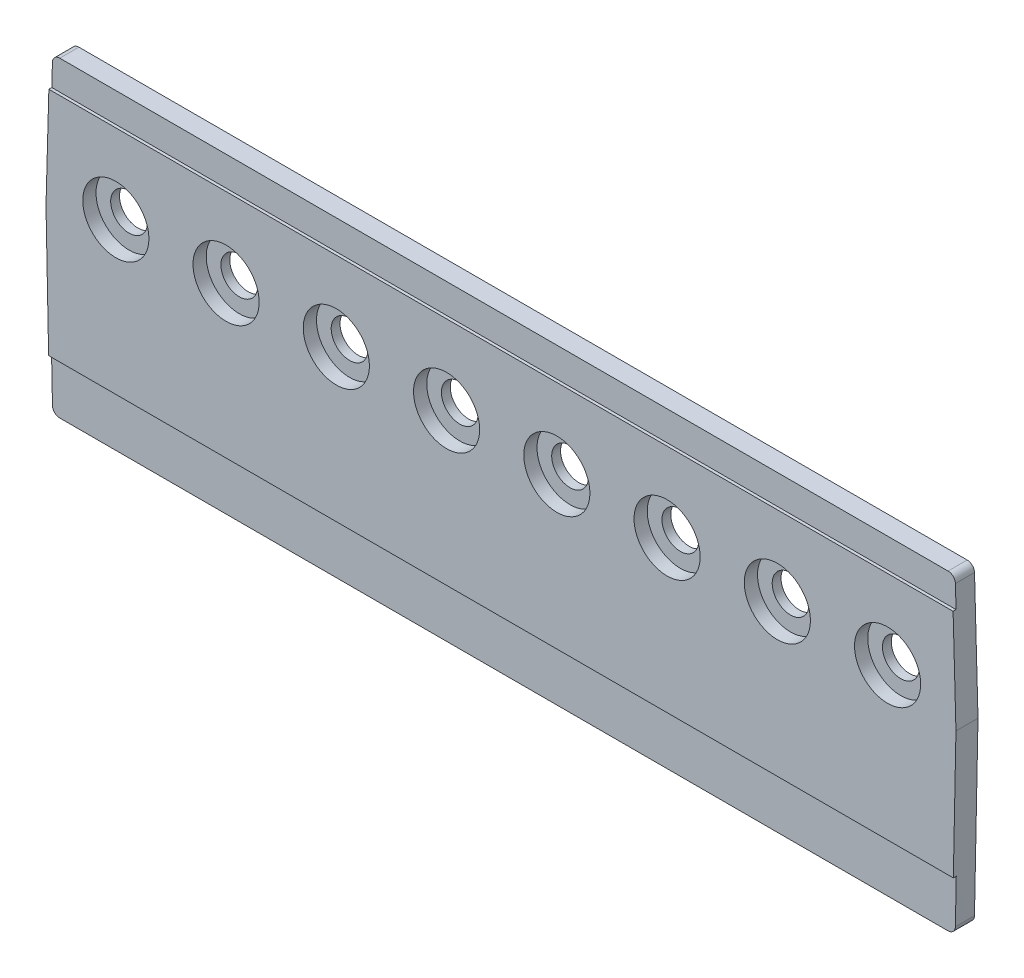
from build123d import *

# Parameters (mm, degrees)
ESQUISSE1_R             = 2.5
BOSS_EXTRU_1_DEPTH      = 3
ESQUISSE2_R             = 4.5
ENL_V_MAT_EXTRU_1_DEPTH = 1.8
ESQUISSE3_W             = 124.375402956
ESQUISSE3_H             = 4
ESQUISSE3_W_2           = 125.335243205
ESQUISSE3_H_2           = 7
ENL_V_MAT_EXTRU_2_DEPTH = 0.4


with BuildPart() as part:
    # Esquisse1 → Boss.-Extru.1 (new body)
    with BuildSketch(Plane.XY):
        with BuildLine():
            Line((1.479800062, 0), (122.320199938, 0))
            ThreePointArc((122.320199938, 0), (123.020055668, 0.285715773), (123.319991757, 0.979596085))
            Line((123.319991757, 0.979596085), (123.8, 24.5))
            Line((123.8, 24.5), (123.327153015, 41.42792207))
            ThreePointArc((123.327153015, 41.42792207), (123.02470786, 42.116910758), (122.327542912, 42.4))
            Line((122.327542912, 42.4), (1.472457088, 42.4))
            ThreePointArc((1.472457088, 42.4), (0.77529214, 42.116910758), (0.472846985, 41.42792207))
            Line((0.472846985, 41.42792207), (0, 24.5))
            Line((0, 24.5), (0.480008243, 0.979596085))
            ThreePointArc((0.480008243, 0.979596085), (0.779944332, 0.285715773), (1.479800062, 0))
        make_face()
        with Locations((9.5, 27.6)):
            Circle(ESQUISSE1_R, mode=Mode.SUBTRACT)
        with Locations((24.5, 27.6)):
            Circle(ESQUISSE1_R, mode=Mode.SUBTRACT)
        with Locations((39.5, 27.6)):
            Circle(ESQUISSE1_R, mode=Mode.SUBTRACT)
        with Locations((54.5, 27.6)):
            Circle(ESQUISSE1_R, mode=Mode.SUBTRACT)
        with Locations((69.5, 27.6)):
            Circle(ESQUISSE1_R, mode=Mode.SUBTRACT)
        with Locations((84.5, 27.6)):
            Circle(ESQUISSE1_R, mode=Mode.SUBTRACT)
        with Locations((99.5, 27.6)):
            Circle(ESQUISSE1_R, mode=Mode.SUBTRACT)
        with Locations((114.5, 27.6)):
            Circle(ESQUISSE1_R, mode=Mode.SUBTRACT)
    extrude(amount=BOSS_EXTRU_1_DEPTH)

    # Esquisse2 → Enl_v. mat.-Extru.1 (cut)
    with BuildSketch(Plane.XY.offset(3)):
        with Locations((9.5, 27.6)):
            Circle(ESQUISSE2_R)
        with Locations((24.5, 27.6)):
            Circle(ESQUISSE2_R)
        with Locations((39.5, 27.6)):
            Circle(ESQUISSE2_R)
        with Locations((54.5, 27.6)):
            Circle(ESQUISSE2_R)
        with Locations((69.5, 27.6)):
            Circle(ESQUISSE2_R)
        with Locations((84.5, 27.6)):
            Circle(ESQUISSE2_R)
        with Locations((99.5, 27.6)):
            Circle(ESQUISSE2_R)
        with Locations((114.5, 27.6)):
            Circle(ESQUISSE2_R)
    extrude(amount=-ENL_V_MAT_EXTRU_1_DEPTH, mode=Mode.SUBTRACT)

    # Esquisse3 → Enl_v. mat.-Extru.2 (cut)
    with BuildSketch(Plane.XY.offset(3)):
        with Locations((62.187701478, 40.4)):
            Rectangle(ESQUISSE3_W, ESQUISSE3_H)
        with Locations((61.707781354, 3.5)):
            Rectangle(ESQUISSE3_W_2, ESQUISSE3_H_2)
    extrude(amount=-ENL_V_MAT_EXTRU_2_DEPTH, mode=Mode.SUBTRACT)


solid = part.part
